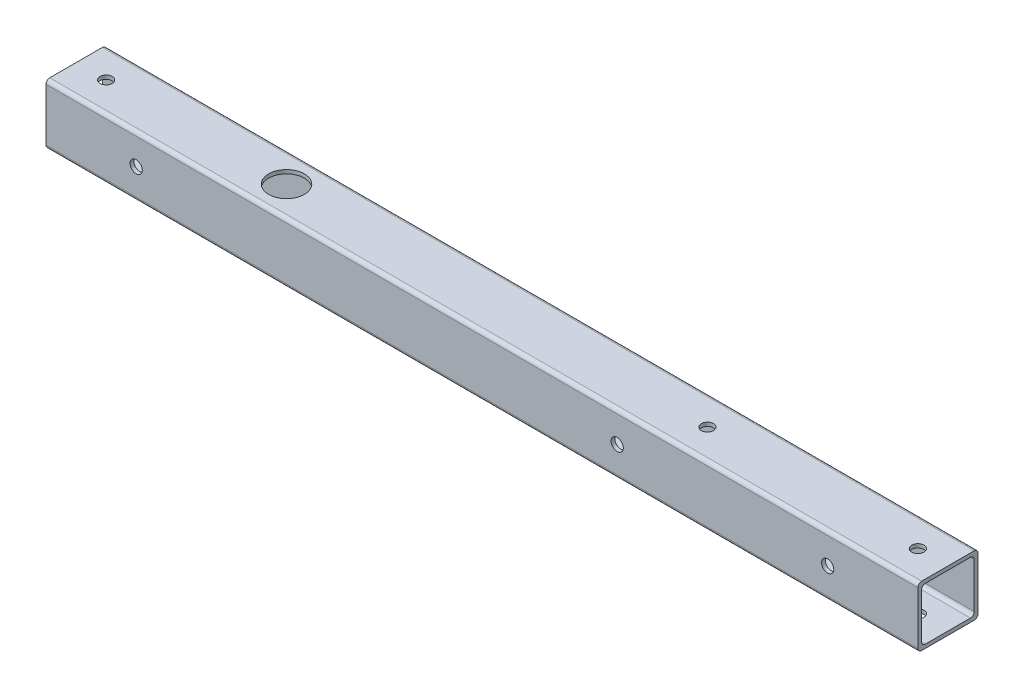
ISO-10303-21;
HEADER;
FILE_DESCRIPTION(('STEP AP214'),'2;1');
FILE_NAME('part.step','',(''),(''),'','','');
FILE_SCHEMA(('AUTOMOTIVE_DESIGN { 1 0 10303 214 1 1 1 1 }'));
ENDSEC;
DATA;
#1=APPLICATION_CONTEXT('core data for automotive mechanical design processes');
#2=APPLICATION_PROTOCOL_DEFINITION('international standard','automotive_design',2000,#1);
#3=PRODUCT_CONTEXT('',#1,'mechanical');
#4=PRODUCT('Part','Part','',(#3));
#5=PRODUCT_RELATED_PRODUCT_CATEGORY('part','',(#4));
#6=PRODUCT_DEFINITION_FORMATION('','',#4);
#7=PRODUCT_DEFINITION_CONTEXT('part definition',#1,'design');
#8=PRODUCT_DEFINITION('design','',#6,#7);
#9=PRODUCT_DEFINITION_SHAPE('','',#8);
#10=(LENGTH_UNIT() NAMED_UNIT(*) SI_UNIT(.MILLI.,.METRE.));
#11=(NAMED_UNIT(*) PLANE_ANGLE_UNIT() SI_UNIT($,.RADIAN.));
#12=(NAMED_UNIT(*) SI_UNIT($,.STERADIAN.) SOLID_ANGLE_UNIT());
#13=UNCERTAINTY_MEASURE_WITH_UNIT(LENGTH_MEASURE(1.E-05),#10,'distance_accuracy_value','');
#14=(GEOMETRIC_REPRESENTATION_CONTEXT(3) GLOBAL_UNCERTAINTY_ASSIGNED_CONTEXT((#13)) GLOBAL_UNIT_ASSIGNED_CONTEXT((#10,
#11,#12)) REPRESENTATION_CONTEXT('',''));
#15=CARTESIAN_POINT('',(0.,0.,0.));
#16=DIRECTION('',(0.,0.,1.));
#17=DIRECTION('',(1.,0.,0.));
#18=AXIS2_PLACEMENT_3D('',#15,#16,#17);
#19=CARTESIAN_POINT('',(0.,101.6,0.));
#20=DIRECTION('',(-1.,0.,0.));
#21=DIRECTION('',(0.,0.,1.));
#22=AXIS2_PLACEMENT_3D('',#19,#20,#21);
#23=PLANE('',#22);
#24=DIRECTION('',(0.,0.,1.));
#25=VECTOR('',#24,1.);
#26=CARTESIAN_POINT('',(0.,95.25,6.35000000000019));
#27=LINE('',#26,#25);
#28=CARTESIAN_POINT('',(0.,95.25,12.7000000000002));
#29=VERTEX_POINT('',#28);
#30=CARTESIAN_POINT('',(0.,95.25,88.9000000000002));
#31=VERTEX_POINT('',#30);
#32=EDGE_CURVE('E169',#29,#31,#27,.T.);
#33=ORIENTED_EDGE('',*,*,#32,.F.);
#34=CARTESIAN_POINT('',(0.,88.9,12.7000000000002));
#35=DIRECTION('',(-1.,0.,0.));
#36=DIRECTION('',(0.,0.,1.));
#37=AXIS2_PLACEMENT_3D('',#34,#35,#36);
#38=CIRCLE('',#37,6.35);
#39=CARTESIAN_POINT('',(0.,88.9,6.35000000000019));
#40=VERTEX_POINT('',#39);
#41=EDGE_CURVE('E179',#29,#40,#38,.T.);
#42=ORIENTED_EDGE('',*,*,#41,.T.);
#43=DIRECTION('',(0.,1.,0.));
#44=VECTOR('',#43,1.);
#45=CARTESIAN_POINT('',(0.,95.25,6.35000000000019));
#46=LINE('',#45,#44);
#47=CARTESIAN_POINT('',(0.,12.7,6.3500000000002));
#48=VERTEX_POINT('',#47);
#49=EDGE_CURVE('E264',#48,#40,#46,.T.);
#50=ORIENTED_EDGE('',*,*,#49,.F.);
#51=CARTESIAN_POINT('',(0.,12.7,12.7000000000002));
#52=DIRECTION('',(-1.,0.,0.));
#53=DIRECTION('',(0.,0.,1.));
#54=AXIS2_PLACEMENT_3D('',#51,#52,#53);
#55=CIRCLE('',#54,6.35);
#56=CARTESIAN_POINT('',(0.,6.35,12.7000000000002));
#57=VERTEX_POINT('',#56);
#58=EDGE_CURVE('E11',#48,#57,#55,.T.);
#59=ORIENTED_EDGE('',*,*,#58,.T.);
#60=DIRECTION('',(0.,0.,-1.));
#61=VECTOR('',#60,1.);
#62=CARTESIAN_POINT('',(0.,6.35,6.35000000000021));
#63=LINE('',#62,#61);
#64=CARTESIAN_POINT('',(0.,6.35,88.9000000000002));
#65=VERTEX_POINT('',#64);
#66=EDGE_CURVE('E277',#65,#57,#63,.T.);
#67=ORIENTED_EDGE('',*,*,#66,.F.);
#68=CARTESIAN_POINT('',(0.,12.7,88.9000000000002));
#69=DIRECTION('',(-1.,0.,0.));
#70=DIRECTION('',(0.,0.,1.));
#71=AXIS2_PLACEMENT_3D('',#68,#69,#70);
#72=CIRCLE('',#71,6.35);
#73=CARTESIAN_POINT('',(0.,12.7,95.2500000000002));
#74=VERTEX_POINT('',#73);
#75=EDGE_CURVE('E168',#65,#74,#72,.T.);
#76=ORIENTED_EDGE('',*,*,#75,.T.);
#77=DIRECTION('',(0.,-1.,0.));
#78=VECTOR('',#77,1.);
#79=CARTESIAN_POINT('',(0.,95.25,95.2500000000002));
#80=LINE('',#79,#78);
#81=CARTESIAN_POINT('',(0.,88.9,95.2500000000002));
#82=VERTEX_POINT('',#81);
#83=EDGE_CURVE('E152',#82,#74,#80,.T.);
#84=ORIENTED_EDGE('',*,*,#83,.F.);
#85=CARTESIAN_POINT('',(0.,88.9,88.9000000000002));
#86=DIRECTION('',(-1.,0.,0.));
#87=DIRECTION('',(0.,0.,1.));
#88=AXIS2_PLACEMENT_3D('',#85,#86,#87);
#89=CIRCLE('',#88,6.35);
#90=EDGE_CURVE('E164',#82,#31,#89,.T.);
#91=ORIENTED_EDGE('',*,*,#90,.T.);
#92=EDGE_LOOP('',(#33,#42,#50,#59,#67,#76,#84,#91));
#93=FACE_BOUND('',#92,.T.);
#94=DIRECTION('',(0.,-1.,0.));
#95=VECTOR('',#94,1.);
#96=CARTESIAN_POINT('',(0.,101.6,101.6));
#97=LINE('',#96,#95);
#98=CARTESIAN_POINT('',(0.,95.25,101.6));
#99=VERTEX_POINT('',#98);
#100=CARTESIAN_POINT('',(0.,6.34999999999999,101.6));
#101=VERTEX_POINT('',#100);
#102=EDGE_CURVE('E288',#99,#101,#97,.T.);
#103=ORIENTED_EDGE('',*,*,#102,.T.);
#104=CARTESIAN_POINT('',(0.,6.34999999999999,95.25));
#105=DIRECTION('',(-1.,0.,0.));
#106=DIRECTION('',(0.,0.,1.));
#107=AXIS2_PLACEMENT_3D('',#104,#105,#106);
#108=CIRCLE('',#107,6.35);
#109=CARTESIAN_POINT('',(0.,0.,95.25));
#110=VERTEX_POINT('',#109);
#111=EDGE_CURVE('E319',#101,#110,#108,.F.);
#112=ORIENTED_EDGE('',*,*,#111,.T.);
#113=DIRECTION('',(0.,0.,-1.));
#114=VECTOR('',#113,1.);
#115=CARTESIAN_POINT('',(0.,0.,0.));
#116=LINE('',#115,#114);
#117=CARTESIAN_POINT('',(0.,0.,6.35));
#118=VERTEX_POINT('',#117);
#119=EDGE_CURVE('E280',#110,#118,#116,.T.);
#120=ORIENTED_EDGE('',*,*,#119,.T.);
#121=CARTESIAN_POINT('',(0.,6.34999999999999,6.35));
#122=DIRECTION('',(-1.,0.,0.));
#123=DIRECTION('',(0.,0.,1.));
#124=AXIS2_PLACEMENT_3D('',#121,#122,#123);
#125=CIRCLE('',#124,6.35);
#126=CARTESIAN_POINT('',(0.,6.34999999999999,0.));
#127=VERTEX_POINT('',#126);
#128=EDGE_CURVE('E313',#118,#127,#125,.F.);
#129=ORIENTED_EDGE('',*,*,#128,.T.);
#130=DIRECTION('',(0.,-1.,0.));
#131=VECTOR('',#130,1.);
#132=CARTESIAN_POINT('',(0.,101.6,0.));
#133=LINE('',#132,#131);
#134=CARTESIAN_POINT('',(0.,95.25,0.));
#135=VERTEX_POINT('',#134);
#136=EDGE_CURVE('E159',#135,#127,#133,.T.);
#137=ORIENTED_EDGE('',*,*,#136,.F.);
#138=CARTESIAN_POINT('',(0.,95.25,6.35));
#139=DIRECTION('',(-1.,0.,0.));
#140=DIRECTION('',(0.,0.,1.));
#141=AXIS2_PLACEMENT_3D('',#138,#139,#140);
#142=CIRCLE('',#141,6.35);
#143=CARTESIAN_POINT('',(0.,101.6,6.35));
#144=VERTEX_POINT('',#143);
#145=EDGE_CURVE('E315',#135,#144,#142,.F.);
#146=ORIENTED_EDGE('',*,*,#145,.T.);
#147=DIRECTION('',(0.,0.,-1.));
#148=VECTOR('',#147,1.);
#149=CARTESIAN_POINT('',(0.,101.6,0.));
#150=LINE('',#149,#148);
#151=CARTESIAN_POINT('',(0.,101.6,95.25));
#152=VERTEX_POINT('',#151);
#153=EDGE_CURVE('E281',#152,#144,#150,.T.);
#154=ORIENTED_EDGE('',*,*,#153,.F.);
#155=CARTESIAN_POINT('',(0.,95.25,95.25));
#156=DIRECTION('',(-1.,0.,0.));
#157=DIRECTION('',(0.,0.,1.));
#158=AXIS2_PLACEMENT_3D('',#155,#156,#157);
#159=CIRCLE('',#158,6.35);
#160=EDGE_CURVE('E317',#152,#99,#159,.F.);
#161=ORIENTED_EDGE('',*,*,#160,.T.);
#162=EDGE_LOOP('',(#103,#112,#120,#129,#137,#146,#154,#161));
#163=FACE_BOUND('',#162,.T.);
#164=ADVANCED_FACE('F31',(#93,#163),#23,.F.);
#165=CARTESIAN_POINT('',(0.,101.6,0.));
#166=DIRECTION('',(0.,0.,1.));
#167=DIRECTION('',(1.,0.,0.));
#168=AXIS2_PLACEMENT_3D('',#165,#166,#167);
#169=PLANE('',#168);
#170=CARTESIAN_POINT('',(-508.,50.7999999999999,0.));
#171=DIRECTION('',(0.,0.,-1.));
#172=DIRECTION('',(-1.,0.,0.));
#173=AXIS2_PLACEMENT_3D('',#170,#171,#172);
#174=CIRCLE('',#173,10.3187499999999);
#175=CARTESIAN_POINT('',(-518.31875,50.7999999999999,0.));
#176=VERTEX_POINT('',#175);
#177=EDGE_CURVE('E219',#176,#176,#174,.T.);
#178=ORIENTED_EDGE('',*,*,#177,.F.);
#179=EDGE_LOOP('',(#178));
#180=FACE_BOUND('',#179,.T.);
#181=CARTESIAN_POINT('',(-152.4,50.8,0.));
#182=DIRECTION('',(0.,0.,-1.));
#183=DIRECTION('',(-1.,0.,0.));
#184=AXIS2_PLACEMENT_3D('',#181,#182,#183);
#185=CIRCLE('',#184,10.31875);
#186=CARTESIAN_POINT('',(-162.71875,50.8,0.));
#187=VERTEX_POINT('',#186);
#188=EDGE_CURVE('E216',#187,#187,#185,.T.);
#189=ORIENTED_EDGE('',*,*,#188,.F.);
#190=EDGE_LOOP('',(#189));
#191=FACE_BOUND('',#190,.T.);
#192=CARTESIAN_POINT('',(-1320.8,50.8,1.6174600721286E-13));
#193=DIRECTION('',(0.,0.,-1.));
#194=DIRECTION('',(-1.,0.,0.));
#195=AXIS2_PLACEMENT_3D('',#192,#193,#194);
#196=CIRCLE('',#195,10.31875);
#197=CARTESIAN_POINT('',(-1331.11875,50.8,1.6300964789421E-13));
#198=VERTEX_POINT('',#197);
#199=EDGE_CURVE('E235',#198,#198,#196,.T.);
#200=ORIENTED_EDGE('',*,*,#199,.F.);
#201=EDGE_LOOP('',(#200));
#202=FACE_BOUND('',#201,.T.);
#203=DIRECTION('',(0.,-1.,0.));
#204=VECTOR('',#203,1.);
#205=CARTESIAN_POINT('',(-1473.2,101.6,1.80409008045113E-13));
#206=LINE('',#205,#204);
#207=CARTESIAN_POINT('',(-1473.2,95.25,1.80409008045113E-13));
#208=VERTEX_POINT('',#207);
#209=CARTESIAN_POINT('',(-1473.2,6.34999999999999,1.80409008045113E-13));
#210=VERTEX_POINT('',#209);
#211=EDGE_CURVE('E298',#208,#210,#206,.T.);
#212=ORIENTED_EDGE('',*,*,#211,.F.);
#213=DIRECTION('',(-1.,0.,0.));
#214=VECTOR('',#213,1.);
#215=CARTESIAN_POINT('',(0.,95.25,0.));
#216=LINE('',#215,#214);
#217=EDGE_CURVE('E347',#208,#135,#216,.F.);
#218=ORIENTED_EDGE('',*,*,#217,.T.);
#219=ORIENTED_EDGE('',*,*,#136,.T.);
#220=DIRECTION('',(-1.,0.,0.));
#221=VECTOR('',#220,1.);
#222=CARTESIAN_POINT('',(-1473.2,6.34999999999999,1.80409008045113E-13));
#223=LINE('',#222,#221);
#224=EDGE_CURVE('E345',#127,#210,#223,.T.);
#225=ORIENTED_EDGE('',*,*,#224,.T.);
#226=EDGE_LOOP('',(#212,#218,#219,#225));
#227=FACE_BOUND('',#226,.T.);
#228=ADVANCED_FACE('F373',(#180,#191,#202,#227),#169,.F.);
#229=CARTESIAN_POINT('',(-1473.2,101.6,1.80409008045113E-13));
#230=DIRECTION('',(1.,0.,0.));
#231=DIRECTION('',(0.,0.,-1.));
#232=AXIS2_PLACEMENT_3D('',#229,#230,#231);
#233=PLANE('',#232);
#234=DIRECTION('',(0.,0.,1.));
#235=VECTOR('',#234,1.);
#236=CARTESIAN_POINT('',(-1473.2,6.35,6.35000000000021));
#237=LINE('',#236,#235);
#238=CARTESIAN_POINT('',(-1473.2,6.35,12.7000000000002));
#239=VERTEX_POINT('',#238);
#240=CARTESIAN_POINT('',(-1473.2,6.35,88.9000000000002));
#241=VERTEX_POINT('',#240);
#242=EDGE_CURVE('E270',#239,#241,#237,.T.);
#243=ORIENTED_EDGE('',*,*,#242,.F.);
#244=CARTESIAN_POINT('',(-1473.2,12.7,12.7000000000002));
#245=DIRECTION('',(1.,0.,0.));
#246=DIRECTION('',(0.,0.,-1.));
#247=AXIS2_PLACEMENT_3D('',#244,#245,#246);
#248=CIRCLE('',#247,6.35);
#249=CARTESIAN_POINT('',(-1473.2,12.7,6.3500000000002));
#250=VERTEX_POINT('',#249);
#251=EDGE_CURVE('E40',#239,#250,#248,.T.);
#252=ORIENTED_EDGE('',*,*,#251,.T.);
#253=DIRECTION('',(0.,-1.,0.));
#254=VECTOR('',#253,1.);
#255=CARTESIAN_POINT('',(-1473.2,95.25,6.35000000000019));
#256=LINE('',#255,#254);
#257=CARTESIAN_POINT('',(-1473.2,88.9,6.35000000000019));
#258=VERTEX_POINT('',#257);
#259=EDGE_CURVE('E267',#258,#250,#256,.T.);
#260=ORIENTED_EDGE('',*,*,#259,.F.);
#261=CARTESIAN_POINT('',(-1473.2,88.9,12.7000000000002));
#262=DIRECTION('',(1.,0.,0.));
#263=DIRECTION('',(0.,0.,-1.));
#264=AXIS2_PLACEMENT_3D('',#261,#262,#263);
#265=CIRCLE('',#264,6.35);
#266=CARTESIAN_POINT('',(-1473.2,95.25,12.7000000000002));
#267=VERTEX_POINT('',#266);
#268=EDGE_CURVE('E176',#258,#267,#265,.T.);
#269=ORIENTED_EDGE('',*,*,#268,.T.);
#270=DIRECTION('',(0.,0.,-1.));
#271=VECTOR('',#270,1.);
#272=CARTESIAN_POINT('',(-1473.2,95.25,6.35000000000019));
#273=LINE('',#272,#271);
#274=CARTESIAN_POINT('',(-1473.2,95.25,88.9000000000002));
#275=VERTEX_POINT('',#274);
#276=EDGE_CURVE('E274',#275,#267,#273,.T.);
#277=ORIENTED_EDGE('',*,*,#276,.F.);
#278=CARTESIAN_POINT('',(-1473.2,88.9,88.9000000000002));
#279=DIRECTION('',(1.,0.,0.));
#280=DIRECTION('',(0.,0.,-1.));
#281=AXIS2_PLACEMENT_3D('',#278,#279,#280);
#282=CIRCLE('',#281,6.35);
#283=CARTESIAN_POINT('',(-1473.2,88.9,95.2500000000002));
#284=VERTEX_POINT('',#283);
#285=EDGE_CURVE('E177',#275,#284,#282,.T.);
#286=ORIENTED_EDGE('',*,*,#285,.T.);
#287=DIRECTION('',(0.,1.,0.));
#288=VECTOR('',#287,1.);
#289=CARTESIAN_POINT('',(-1473.2,95.25,95.2500000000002));
#290=LINE('',#289,#288);
#291=CARTESIAN_POINT('',(-1473.2,12.7,95.2500000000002));
#292=VERTEX_POINT('',#291);
#293=EDGE_CURVE('E155',#292,#284,#290,.T.);
#294=ORIENTED_EDGE('',*,*,#293,.F.);
#295=CARTESIAN_POINT('',(-1473.2,12.7,88.9000000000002));
#296=DIRECTION('',(1.,0.,0.));
#297=DIRECTION('',(0.,0.,-1.));
#298=AXIS2_PLACEMENT_3D('',#295,#296,#297);
#299=CIRCLE('',#298,6.35);
#300=EDGE_CURVE('E349',#292,#241,#299,.T.);
#301=ORIENTED_EDGE('',*,*,#300,.T.);
#302=EDGE_LOOP('',(#243,#252,#260,#269,#277,#286,#294,#301));
#303=FACE_BOUND('',#302,.T.);
#304=DIRECTION('',(0.,0.,1.));
#305=VECTOR('',#304,1.);
#306=CARTESIAN_POINT('',(-1473.2,0.,1.80409008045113E-13));
#307=LINE('',#306,#305);
#308=CARTESIAN_POINT('',(-1473.2,0.,6.35000000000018));
#309=VERTEX_POINT('',#308);
#310=CARTESIAN_POINT('',(-1473.2,0.,95.2500000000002));
#311=VERTEX_POINT('',#310);
#312=EDGE_CURVE('E285',#309,#311,#307,.T.);
#313=ORIENTED_EDGE('',*,*,#312,.T.);
#314=CARTESIAN_POINT('',(-1473.2,6.34999999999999,95.2500000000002));
#315=DIRECTION('',(1.,0.,0.));
#316=DIRECTION('',(0.,0.,-1.));
#317=AXIS2_PLACEMENT_3D('',#314,#315,#316);
#318=CIRCLE('',#317,6.35);
#319=CARTESIAN_POINT('',(-1473.2,6.34999999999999,101.6));
#320=VERTEX_POINT('',#319);
#321=EDGE_CURVE('E329',#311,#320,#318,.F.);
#322=ORIENTED_EDGE('',*,*,#321,.T.);
#323=DIRECTION('',(0.,-1.,0.));
#324=VECTOR('',#323,1.);
#325=CARTESIAN_POINT('',(-1473.2,101.6,101.6));
#326=LINE('',#325,#324);
#327=CARTESIAN_POINT('',(-1473.2,95.25,101.6));
#328=VERTEX_POINT('',#327);
#329=EDGE_CURVE('E295',#328,#320,#326,.T.);
#330=ORIENTED_EDGE('',*,*,#329,.F.);
#331=CARTESIAN_POINT('',(-1473.2,95.25,95.2500000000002));
#332=DIRECTION('',(1.,0.,0.));
#333=DIRECTION('',(0.,0.,-1.));
#334=AXIS2_PLACEMENT_3D('',#331,#332,#333);
#335=CIRCLE('',#334,6.35);
#336=CARTESIAN_POINT('',(-1473.2,101.6,95.2500000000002));
#337=VERTEX_POINT('',#336);
#338=EDGE_CURVE('E327',#328,#337,#335,.F.);
#339=ORIENTED_EDGE('',*,*,#338,.T.);
#340=DIRECTION('',(0.,0.,1.));
#341=VECTOR('',#340,1.);
#342=CARTESIAN_POINT('',(-1473.2,101.6,1.80409008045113E-13));
#343=LINE('',#342,#341);
#344=CARTESIAN_POINT('',(-1473.2,101.6,6.35000000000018));
#345=VERTEX_POINT('',#344);
#346=EDGE_CURVE('E284',#345,#337,#343,.T.);
#347=ORIENTED_EDGE('',*,*,#346,.F.);
#348=CARTESIAN_POINT('',(-1473.2,95.25,6.35000000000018));
#349=DIRECTION('',(1.,0.,0.));
#350=DIRECTION('',(0.,0.,-1.));
#351=AXIS2_PLACEMENT_3D('',#348,#349,#350);
#352=CIRCLE('',#351,6.35);
#353=EDGE_CURVE('E56',#345,#208,#352,.F.);
#354=ORIENTED_EDGE('',*,*,#353,.T.);
#355=ORIENTED_EDGE('',*,*,#211,.T.);
#356=CARTESIAN_POINT('',(-1473.2,6.34999999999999,6.35000000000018));
#357=DIRECTION('',(1.,0.,0.));
#358=DIRECTION('',(0.,0.,-1.));
#359=AXIS2_PLACEMENT_3D('',#356,#357,#358);
#360=CIRCLE('',#359,6.35);
#361=EDGE_CURVE('E48',#210,#309,#360,.F.);
#362=ORIENTED_EDGE('',*,*,#361,.T.);
#363=EDGE_LOOP('',(#313,#322,#330,#339,#347,#354,#355,#362));
#364=FACE_BOUND('',#363,.T.);
#365=ADVANCED_FACE('F352',(#303,#364),#233,.F.);
#366=CARTESIAN_POINT('',(0.,101.6,101.6));
#367=DIRECTION('',(0.,0.,-1.));
#368=DIRECTION('',(-1.,0.,0.));
#369=AXIS2_PLACEMENT_3D('',#366,#367,#368);
#370=PLANE('',#369);
#371=CARTESIAN_POINT('',(-508.,50.7999999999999,101.6));
#372=DIRECTION('',(0.,0.,-1.));
#373=DIRECTION('',(-1.,0.,0.));
#374=AXIS2_PLACEMENT_3D('',#371,#372,#373);
#375=CIRCLE('',#374,10.3187499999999);
#376=CARTESIAN_POINT('',(-518.31875,50.7999999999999,101.6));
#377=VERTEX_POINT('',#376);
#378=EDGE_CURVE('E212',#377,#377,#375,.T.);
#379=ORIENTED_EDGE('',*,*,#378,.T.);
#380=EDGE_LOOP('',(#379));
#381=FACE_BOUND('',#380,.T.);
#382=CARTESIAN_POINT('',(-152.4,50.8,101.6));
#383=DIRECTION('',(0.,0.,-1.));
#384=DIRECTION('',(-1.,0.,0.));
#385=AXIS2_PLACEMENT_3D('',#382,#383,#384);
#386=CIRCLE('',#385,10.31875);
#387=CARTESIAN_POINT('',(-162.71875,50.8,101.6));
#388=VERTEX_POINT('',#387);
#389=EDGE_CURVE('E208',#388,#388,#386,.T.);
#390=ORIENTED_EDGE('',*,*,#389,.T.);
#391=EDGE_LOOP('',(#390));
#392=FACE_BOUND('',#391,.T.);
#393=CARTESIAN_POINT('',(-1320.8,50.8,101.6));
#394=DIRECTION('',(0.,0.,-1.));
#395=DIRECTION('',(-1.,0.,0.));
#396=AXIS2_PLACEMENT_3D('',#393,#394,#395);
#397=CIRCLE('',#396,10.31875);
#398=CARTESIAN_POINT('',(-1331.11875,50.8,101.6));
#399=VERTEX_POINT('',#398);
#400=EDGE_CURVE('E204',#399,#399,#397,.T.);
#401=ORIENTED_EDGE('',*,*,#400,.T.);
#402=EDGE_LOOP('',(#401));
#403=FACE_BOUND('',#402,.T.);
#404=ORIENTED_EDGE('',*,*,#329,.T.);
#405=DIRECTION('',(1.,0.,0.));
#406=VECTOR('',#405,1.);
#407=CARTESIAN_POINT('',(0.,6.34999999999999,101.6));
#408=LINE('',#407,#406);
#409=EDGE_CURVE('E310',#320,#101,#408,.T.);
#410=ORIENTED_EDGE('',*,*,#409,.T.);
#411=ORIENTED_EDGE('',*,*,#102,.F.);
#412=DIRECTION('',(1.,0.,0.));
#413=VECTOR('',#412,1.);
#414=CARTESIAN_POINT('',(0.,95.25,101.6));
#415=LINE('',#414,#413);
#416=EDGE_CURVE('E308',#99,#328,#415,.F.);
#417=ORIENTED_EDGE('',*,*,#416,.T.);
#418=EDGE_LOOP('',(#404,#410,#411,#417));
#419=FACE_BOUND('',#418,.T.);
#420=ADVANCED_FACE('F382',(#381,#392,#403,#419),#370,.F.);
#421=CARTESIAN_POINT('',(0.,101.6,0.));
#422=DIRECTION('',(0.,-1.,0.));
#423=DIRECTION('',(0.,0.,-1.));
#424=AXIS2_PLACEMENT_3D('',#421,#422,#423);
#425=PLANE('',#424);
#426=CARTESIAN_POINT('',(-406.4,101.6,50.8000000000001));
#427=DIRECTION('',(0.,1.,0.));
#428=DIRECTION('',(0.,0.,1.));
#429=AXIS2_PLACEMENT_3D('',#426,#427,#428);
#430=CIRCLE('',#429,10.31875);
#431=CARTESIAN_POINT('',(-406.4,101.6,61.11875));
#432=VERTEX_POINT('',#431);
#433=EDGE_CURVE('E444',#432,#432,#430,.T.);
#434=ORIENTED_EDGE('',*,*,#433,.F.);
#435=EDGE_LOOP('',(#434));
#436=FACE_BOUND('',#435,.T.);
#437=CARTESIAN_POINT('',(-1117.6,101.6,50.8000000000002));
#438=DIRECTION('',(0.,1.,0.));
#439=DIRECTION('',(0.,0.,1.));
#440=AXIS2_PLACEMENT_3D('',#437,#438,#439);
#441=CIRCLE('',#440,30.1625000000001);
#442=CARTESIAN_POINT('',(-1117.6,101.6,80.9625000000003));
#443=VERTEX_POINT('',#442);
#444=EDGE_CURVE('E242',#443,#443,#441,.T.);
#445=ORIENTED_EDGE('',*,*,#444,.F.);
#446=EDGE_LOOP('',(#445));
#447=FACE_BOUND('',#446,.T.);
#448=CARTESIAN_POINT('',(-50.8,101.6,50.8));
#449=DIRECTION('',(0.,1.,0.));
#450=DIRECTION('',(0.,0.,1.));
#451=AXIS2_PLACEMENT_3D('',#448,#449,#450);
#452=CIRCLE('',#451,10.31875);
#453=CARTESIAN_POINT('',(-50.8,101.6,61.11875));
#454=VERTEX_POINT('',#453);
#455=EDGE_CURVE('E249',#454,#454,#452,.T.);
#456=ORIENTED_EDGE('',*,*,#455,.F.);
#457=EDGE_LOOP('',(#456));
#458=FACE_BOUND('',#457,.T.);
#459=CARTESIAN_POINT('',(-1422.4,101.6,50.8000000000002));
#460=DIRECTION('',(0.,1.,0.));
#461=DIRECTION('',(0.,0.,1.));
#462=AXIS2_PLACEMENT_3D('',#459,#460,#461);
#463=CIRCLE('',#462,10.31875);
#464=CARTESIAN_POINT('',(-1422.4,101.6,61.1187500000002));
#465=VERTEX_POINT('',#464);
#466=EDGE_CURVE('E256',#465,#465,#463,.T.);
#467=ORIENTED_EDGE('',*,*,#466,.F.);
#468=EDGE_LOOP('',(#467));
#469=FACE_BOUND('',#468,.T.);
#470=ORIENTED_EDGE('',*,*,#346,.T.);
#471=DIRECTION('',(1.,0.,0.));
#472=VECTOR('',#471,1.);
#473=CARTESIAN_POINT('',(0.,101.6,95.25));
#474=LINE('',#473,#472);
#475=EDGE_CURVE('E334',#337,#152,#474,.T.);
#476=ORIENTED_EDGE('',*,*,#475,.T.);
#477=ORIENTED_EDGE('',*,*,#153,.T.);
#478=DIRECTION('',(-1.,0.,0.));
#479=VECTOR('',#478,1.);
#480=CARTESIAN_POINT('',(0.,101.6,6.35));
#481=LINE('',#480,#479);
#482=EDGE_CURVE('E331',#144,#345,#481,.T.);
#483=ORIENTED_EDGE('',*,*,#482,.T.);
#484=EDGE_LOOP('',(#470,#476,#477,#483));
#485=FACE_BOUND('',#484,.T.);
#486=ADVANCED_FACE('F385',(#436,#447,#458,#469,#485),#425,.F.);
#487=CARTESIAN_POINT('',(0.,0.,0.));
#488=DIRECTION('',(0.,-1.,0.));
#489=DIRECTION('',(0.,0.,-1.));
#490=AXIS2_PLACEMENT_3D('',#487,#488,#489);
#491=PLANE('',#490);
#492=CARTESIAN_POINT('',(-406.4,0.,50.8000000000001));
#493=DIRECTION('',(0.,1.,0.));
#494=DIRECTION('',(0.,0.,1.));
#495=AXIS2_PLACEMENT_3D('',#492,#493,#494);
#496=CIRCLE('',#495,10.31875);
#497=CARTESIAN_POINT('',(-406.4,0.,61.11875));
#498=VERTEX_POINT('',#497);
#499=EDGE_CURVE('E448',#498,#498,#496,.T.);
#500=ORIENTED_EDGE('',*,*,#499,.T.);
#501=EDGE_LOOP('',(#500));
#502=FACE_BOUND('',#501,.T.);
#503=CARTESIAN_POINT('',(-1117.6,0.,50.8000000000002));
#504=DIRECTION('',(0.,1.,0.));
#505=DIRECTION('',(0.,0.,1.));
#506=AXIS2_PLACEMENT_3D('',#503,#504,#505);
#507=CIRCLE('',#506,30.1625000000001);
#508=CARTESIAN_POINT('',(-1117.6,0.,80.9625000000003));
#509=VERTEX_POINT('',#508);
#510=EDGE_CURVE('E199',#509,#509,#507,.T.);
#511=ORIENTED_EDGE('',*,*,#510,.T.);
#512=EDGE_LOOP('',(#511));
#513=FACE_BOUND('',#512,.T.);
#514=CARTESIAN_POINT('',(-50.8,0.,50.8));
#515=DIRECTION('',(0.,1.,0.));
#516=DIRECTION('',(0.,0.,1.));
#517=AXIS2_PLACEMENT_3D('',#514,#515,#516);
#518=CIRCLE('',#517,10.31875);
#519=CARTESIAN_POINT('',(-50.8,0.,61.11875));
#520=VERTEX_POINT('',#519);
#521=EDGE_CURVE('E194',#520,#520,#518,.T.);
#522=ORIENTED_EDGE('',*,*,#521,.T.);
#523=EDGE_LOOP('',(#522));
#524=FACE_BOUND('',#523,.T.);
#525=CARTESIAN_POINT('',(-1422.4,0.,50.8000000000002));
#526=DIRECTION('',(0.,1.,0.));
#527=DIRECTION('',(0.,0.,1.));
#528=AXIS2_PLACEMENT_3D('',#525,#526,#527);
#529=CIRCLE('',#528,10.31875);
#530=CARTESIAN_POINT('',(-1422.4,0.,61.1187500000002));
#531=VERTEX_POINT('',#530);
#532=EDGE_CURVE('E189',#531,#531,#529,.T.);
#533=ORIENTED_EDGE('',*,*,#532,.T.);
#534=EDGE_LOOP('',(#533));
#535=FACE_BOUND('',#534,.T.);
#536=ORIENTED_EDGE('',*,*,#119,.F.);
#537=DIRECTION('',(1.,0.,0.));
#538=VECTOR('',#537,1.);
#539=CARTESIAN_POINT('',(-1473.2,0.,95.2500000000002));
#540=LINE('',#539,#538);
#541=EDGE_CURVE('E323',#110,#311,#540,.F.);
#542=ORIENTED_EDGE('',*,*,#541,.T.);
#543=ORIENTED_EDGE('',*,*,#312,.F.);
#544=DIRECTION('',(-1.,0.,0.));
#545=VECTOR('',#544,1.);
#546=CARTESIAN_POINT('',(0.,0.,6.35));
#547=LINE('',#546,#545);
#548=EDGE_CURVE('E321',#309,#118,#547,.F.);
#549=ORIENTED_EDGE('',*,*,#548,.T.);
#550=EDGE_LOOP('',(#536,#542,#543,#549));
#551=FACE_BOUND('',#550,.T.);
#552=ADVANCED_FACE('F386',(#502,#513,#524,#535,#551),#491,.T.);
#553=CARTESIAN_POINT('',(0.000999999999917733,95.25,6.35000000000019));
#554=DIRECTION('',(0.,0.,-1.));
#555=DIRECTION('',(0.,1.,0.));
#556=AXIS2_PLACEMENT_3D('',#553,#554,#555);
#557=PLANE('',#556);
#558=CARTESIAN_POINT('',(-508.,50.7999999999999,6.3500000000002));
#559=DIRECTION('',(0.,0.,-1.));
#560=DIRECTION('',(0.,1.,0.));
#561=AXIS2_PLACEMENT_3D('',#558,#559,#560);
#562=CIRCLE('',#561,10.3187499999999);
#563=CARTESIAN_POINT('',(-508.,61.1187499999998,6.3500000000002));
#564=VERTEX_POINT('',#563);
#565=EDGE_CURVE('E211',#564,#564,#562,.T.);
#566=ORIENTED_EDGE('',*,*,#565,.T.);
#567=EDGE_LOOP('',(#566));
#568=FACE_BOUND('',#567,.T.);
#569=CARTESIAN_POINT('',(-152.4,50.8,6.3500000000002));
#570=DIRECTION('',(0.,0.,-1.));
#571=DIRECTION('',(0.,1.,0.));
#572=AXIS2_PLACEMENT_3D('',#569,#570,#571);
#573=CIRCLE('',#572,10.31875);
#574=CARTESIAN_POINT('',(-152.4,61.11875,6.3500000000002));
#575=VERTEX_POINT('',#574);
#576=EDGE_CURVE('E207',#575,#575,#573,.T.);
#577=ORIENTED_EDGE('',*,*,#576,.T.);
#578=EDGE_LOOP('',(#577));
#579=FACE_BOUND('',#578,.T.);
#580=CARTESIAN_POINT('',(-1320.8,50.8,6.3500000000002));
#581=DIRECTION('',(0.,0.,-1.));
#582=DIRECTION('',(0.,1.,0.));
#583=AXIS2_PLACEMENT_3D('',#580,#581,#582);
#584=CIRCLE('',#583,10.31875);
#585=CARTESIAN_POINT('',(-1320.8,61.11875,6.3500000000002));
#586=VERTEX_POINT('',#585);
#587=EDGE_CURVE('E203',#586,#586,#584,.T.);
#588=ORIENTED_EDGE('',*,*,#587,.T.);
#589=EDGE_LOOP('',(#588));
#590=FACE_BOUND('',#589,.T.);
#591=ORIENTED_EDGE('',*,*,#49,.T.);
#592=DIRECTION('',(-1.,0.,0.));
#593=VECTOR('',#592,1.);
#594=CARTESIAN_POINT('',(-1473.2,88.9,6.35000000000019));
#595=LINE('',#594,#593);
#596=EDGE_CURVE('E342',#40,#258,#595,.T.);
#597=ORIENTED_EDGE('',*,*,#596,.T.);
#598=ORIENTED_EDGE('',*,*,#259,.T.);
#599=DIRECTION('',(-1.,0.,0.));
#600=VECTOR('',#599,1.);
#601=CARTESIAN_POINT('',(0.,12.7,6.3500000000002));
#602=LINE('',#601,#600);
#603=EDGE_CURVE('E340',#250,#48,#602,.F.);
#604=ORIENTED_EDGE('',*,*,#603,.T.);
#605=EDGE_LOOP('',(#591,#597,#598,#604));
#606=FACE_BOUND('',#605,.T.);
#607=ADVANCED_FACE('F389',(#568,#579,#590,#606),#557,.F.);
#608=CARTESIAN_POINT('',(0.000999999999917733,95.25,6.35000000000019));
#609=DIRECTION('',(0.,1.,0.));
#610=DIRECTION('',(0.,0.,1.));
#611=AXIS2_PLACEMENT_3D('',#608,#609,#610);
#612=PLANE('',#611);
#613=CARTESIAN_POINT('',(-406.4,95.25,50.8000000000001));
#614=DIRECTION('',(0.,1.,0.));
#615=DIRECTION('',(0.,0.,1.));
#616=AXIS2_PLACEMENT_3D('',#613,#614,#615);
#617=CIRCLE('',#616,10.31875);
#618=CARTESIAN_POINT('',(-406.4,95.25,61.11875));
#619=VERTEX_POINT('',#618);
#620=EDGE_CURVE('E224',#619,#619,#617,.T.);
#621=ORIENTED_EDGE('',*,*,#620,.T.);
#622=EDGE_LOOP('',(#621));
#623=FACE_BOUND('',#622,.T.);
#624=CARTESIAN_POINT('',(-1117.6,95.25,50.8000000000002));
#625=DIRECTION('',(0.,1.,0.));
#626=DIRECTION('',(0.,0.,1.));
#627=AXIS2_PLACEMENT_3D('',#624,#625,#626);
#628=CIRCLE('',#627,30.1625000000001);
#629=CARTESIAN_POINT('',(-1117.6,95.25,80.9625000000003));
#630=VERTEX_POINT('',#629);
#631=EDGE_CURVE('E198',#630,#630,#628,.T.);
#632=ORIENTED_EDGE('',*,*,#631,.T.);
#633=EDGE_LOOP('',(#632));
#634=FACE_BOUND('',#633,.T.);
#635=CARTESIAN_POINT('',(-50.8,95.25,50.8));
#636=DIRECTION('',(0.,1.,0.));
#637=DIRECTION('',(0.,0.,1.));
#638=AXIS2_PLACEMENT_3D('',#635,#636,#637);
#639=CIRCLE('',#638,10.31875);
#640=CARTESIAN_POINT('',(-50.8,95.25,61.11875));
#641=VERTEX_POINT('',#640);
#642=EDGE_CURVE('E193',#641,#641,#639,.T.);
#643=ORIENTED_EDGE('',*,*,#642,.T.);
#644=EDGE_LOOP('',(#643));
#645=FACE_BOUND('',#644,.T.);
#646=CARTESIAN_POINT('',(-1422.4,95.25,50.8000000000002));
#647=DIRECTION('',(0.,1.,0.));
#648=DIRECTION('',(0.,0.,1.));
#649=AXIS2_PLACEMENT_3D('',#646,#647,#648);
#650=CIRCLE('',#649,10.31875);
#651=CARTESIAN_POINT('',(-1422.4,95.25,61.1187500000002));
#652=VERTEX_POINT('',#651);
#653=EDGE_CURVE('E170',#652,#652,#650,.T.);
#654=ORIENTED_EDGE('',*,*,#653,.T.);
#655=EDGE_LOOP('',(#654));
#656=FACE_BOUND('',#655,.T.);
#657=ORIENTED_EDGE('',*,*,#32,.T.);
#658=DIRECTION('',(-1.,0.,0.));
#659=VECTOR('',#658,1.);
#660=CARTESIAN_POINT('',(-1473.2,95.25,88.9000000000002));
#661=LINE('',#660,#659);
#662=EDGE_CURVE('E175',#31,#275,#661,.T.);
#663=ORIENTED_EDGE('',*,*,#662,.T.);
#664=ORIENTED_EDGE('',*,*,#276,.T.);
#665=DIRECTION('',(-1.,0.,0.));
#666=VECTOR('',#665,1.);
#667=CARTESIAN_POINT('',(0.,95.25,12.7000000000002));
#668=LINE('',#667,#666);
#669=EDGE_CURVE('E337',#267,#29,#668,.F.);
#670=ORIENTED_EDGE('',*,*,#669,.T.);
#671=EDGE_LOOP('',(#657,#663,#664,#670));
#672=FACE_BOUND('',#671,.T.);
#673=ADVANCED_FACE('F395',(#623,#634,#645,#656,#672),#612,.F.);
#674=CARTESIAN_POINT('',(0.000999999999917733,95.25,95.2500000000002));
#675=DIRECTION('',(0.,0.,1.));
#676=DIRECTION('',(0.,-1.,0.));
#677=AXIS2_PLACEMENT_3D('',#674,#675,#676);
#678=PLANE('',#677);
#679=CARTESIAN_POINT('',(-508.,50.7999999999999,95.2500000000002));
#680=DIRECTION('',(0.,0.,1.));
#681=DIRECTION('',(0.,-1.,0.));
#682=AXIS2_PLACEMENT_3D('',#679,#680,#681);
#683=CIRCLE('',#682,10.3187499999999);
#684=CARTESIAN_POINT('',(-508.,40.48125,95.2500000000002));
#685=VERTEX_POINT('',#684);
#686=EDGE_CURVE('E209',#685,#685,#683,.T.);
#687=ORIENTED_EDGE('',*,*,#686,.T.);
#688=EDGE_LOOP('',(#687));
#689=FACE_BOUND('',#688,.T.);
#690=CARTESIAN_POINT('',(-152.4,50.8,95.2500000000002));
#691=DIRECTION('',(0.,0.,1.));
#692=DIRECTION('',(0.,-1.,0.));
#693=AXIS2_PLACEMENT_3D('',#690,#691,#692);
#694=CIRCLE('',#693,10.31875);
#695=CARTESIAN_POINT('',(-152.4,40.48125,95.2500000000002));
#696=VERTEX_POINT('',#695);
#697=EDGE_CURVE('E205',#696,#696,#694,.T.);
#698=ORIENTED_EDGE('',*,*,#697,.T.);
#699=EDGE_LOOP('',(#698));
#700=FACE_BOUND('',#699,.T.);
#701=CARTESIAN_POINT('',(-1320.8,50.8,95.2500000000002));
#702=DIRECTION('',(0.,0.,1.));
#703=DIRECTION('',(0.,-1.,0.));
#704=AXIS2_PLACEMENT_3D('',#701,#702,#703);
#705=CIRCLE('',#704,10.31875);
#706=CARTESIAN_POINT('',(-1320.8,40.48125,95.2500000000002));
#707=VERTEX_POINT('',#706);
#708=EDGE_CURVE('E200',#707,#707,#705,.T.);
#709=ORIENTED_EDGE('',*,*,#708,.T.);
#710=EDGE_LOOP('',(#709));
#711=FACE_BOUND('',#710,.T.);
#712=ORIENTED_EDGE('',*,*,#83,.T.);
#713=DIRECTION('',(-1.,0.,0.));
#714=VECTOR('',#713,1.);
#715=CARTESIAN_POINT('',(-1473.2,12.7,95.2500000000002));
#716=LINE('',#715,#714);
#717=EDGE_CURVE('E158',#74,#292,#716,.T.);
#718=ORIENTED_EDGE('',*,*,#717,.T.);
#719=ORIENTED_EDGE('',*,*,#293,.T.);
#720=DIRECTION('',(-1.,0.,0.));
#721=VECTOR('',#720,1.);
#722=CARTESIAN_POINT('',(0.,88.9,95.2500000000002));
#723=LINE('',#722,#721);
#724=EDGE_CURVE('E148',#284,#82,#723,.F.);
#725=ORIENTED_EDGE('',*,*,#724,.T.);
#726=EDGE_LOOP('',(#712,#718,#719,#725));
#727=FACE_BOUND('',#726,.T.);
#728=ADVANCED_FACE('F150',(#689,#700,#711,#727),#678,.F.);
#729=CARTESIAN_POINT('',(0.000999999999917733,6.35,6.35000000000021));
#730=DIRECTION('',(0.,-1.,0.));
#731=DIRECTION('',(0.,0.,-1.));
#732=AXIS2_PLACEMENT_3D('',#729,#730,#731);
#733=PLANE('',#732);
#734=CARTESIAN_POINT('',(-406.4,6.35,50.8000000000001));
#735=DIRECTION('',(0.,-1.,0.));
#736=DIRECTION('',(0.,0.,-1.));
#737=AXIS2_PLACEMENT_3D('',#734,#735,#736);
#738=CIRCLE('',#737,10.31875);
#739=CARTESIAN_POINT('',(-406.4,6.35,40.4812500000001));
#740=VERTEX_POINT('',#739);
#741=EDGE_CURVE('E35',#740,#740,#738,.T.);
#742=ORIENTED_EDGE('',*,*,#741,.T.);
#743=EDGE_LOOP('',(#742));
#744=FACE_BOUND('',#743,.T.);
#745=CARTESIAN_POINT('',(-1117.6,6.35,50.8000000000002));
#746=DIRECTION('',(0.,-1.,0.));
#747=DIRECTION('',(0.,0.,-1.));
#748=AXIS2_PLACEMENT_3D('',#745,#746,#747);
#749=CIRCLE('',#748,30.1625000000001);
#750=CARTESIAN_POINT('',(-1117.6,6.35,20.6375000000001));
#751=VERTEX_POINT('',#750);
#752=EDGE_CURVE('E195',#751,#751,#749,.T.);
#753=ORIENTED_EDGE('',*,*,#752,.T.);
#754=EDGE_LOOP('',(#753));
#755=FACE_BOUND('',#754,.T.);
#756=CARTESIAN_POINT('',(-50.8,6.35,50.8));
#757=DIRECTION('',(0.,-1.,0.));
#758=DIRECTION('',(0.,0.,-1.));
#759=AXIS2_PLACEMENT_3D('',#756,#757,#758);
#760=CIRCLE('',#759,10.31875);
#761=CARTESIAN_POINT('',(-50.8,6.35,40.48125));
#762=VERTEX_POINT('',#761);
#763=EDGE_CURVE('E190',#762,#762,#760,.T.);
#764=ORIENTED_EDGE('',*,*,#763,.T.);
#765=EDGE_LOOP('',(#764));
#766=FACE_BOUND('',#765,.T.);
#767=CARTESIAN_POINT('',(-1422.4,6.35,50.8000000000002));
#768=DIRECTION('',(0.,-1.,0.));
#769=DIRECTION('',(0.,0.,-1.));
#770=AXIS2_PLACEMENT_3D('',#767,#768,#769);
#771=CIRCLE('',#770,10.31875);
#772=CARTESIAN_POINT('',(-1422.4,6.35,40.4812500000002));
#773=VERTEX_POINT('',#772);
#774=EDGE_CURVE('E186',#773,#773,#771,.T.);
#775=ORIENTED_EDGE('',*,*,#774,.T.);
#776=EDGE_LOOP('',(#775));
#777=FACE_BOUND('',#776,.T.);
#778=ORIENTED_EDGE('',*,*,#242,.T.);
#779=DIRECTION('',(-1.,0.,0.));
#780=VECTOR('',#779,1.);
#781=CARTESIAN_POINT('',(0.,6.35,88.9000000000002));
#782=LINE('',#781,#780);
#783=EDGE_CURVE('E306',#241,#65,#782,.F.);
#784=ORIENTED_EDGE('',*,*,#783,.T.);
#785=ORIENTED_EDGE('',*,*,#66,.T.);
#786=DIRECTION('',(-1.,0.,0.));
#787=VECTOR('',#786,1.);
#788=CARTESIAN_POINT('',(-1473.2,6.35,12.7000000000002));
#789=LINE('',#788,#787);
#790=EDGE_CURVE('E303',#57,#239,#789,.T.);
#791=ORIENTED_EDGE('',*,*,#790,.T.);
#792=EDGE_LOOP('',(#778,#784,#785,#791));
#793=FACE_BOUND('',#792,.T.);
#794=ADVANCED_FACE('F356',(#744,#755,#766,#777,#793),#733,.F.);
#795=CARTESIAN_POINT('',(0.000999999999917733,12.7,88.9000000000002));
#796=DIRECTION('',(1.,0.,0.));
#797=DIRECTION('',(0.,0.,-1.));
#798=AXIS2_PLACEMENT_3D('',#795,#796,#797);
#799=CYLINDRICAL_SURFACE('',#798,6.35);
#800=ORIENTED_EDGE('',*,*,#75,.F.);
#801=ORIENTED_EDGE('',*,*,#783,.F.);
#802=ORIENTED_EDGE('',*,*,#300,.F.);
#803=ORIENTED_EDGE('',*,*,#717,.F.);
#804=EDGE_LOOP('',(#800,#801,#802,#803));
#805=FACE_BOUND('',#804,.T.);
#806=ADVANCED_FACE('F358',(#805),#799,.F.);
#807=CARTESIAN_POINT('',(0.,6.34999999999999,95.25));
#808=DIRECTION('',(-1.,0.,0.));
#809=DIRECTION('',(0.,0.,1.));
#810=AXIS2_PLACEMENT_3D('',#807,#808,#809);
#811=CYLINDRICAL_SURFACE('',#810,6.35);
#812=ORIENTED_EDGE('',*,*,#321,.F.);
#813=ORIENTED_EDGE('',*,*,#541,.F.);
#814=ORIENTED_EDGE('',*,*,#111,.F.);
#815=ORIENTED_EDGE('',*,*,#409,.F.);
#816=EDGE_LOOP('',(#812,#813,#814,#815));
#817=FACE_BOUND('',#816,.T.);
#818=ADVANCED_FACE('F360',(#817),#811,.T.);
#819=CARTESIAN_POINT('',(0.,95.25,95.25));
#820=DIRECTION('',(1.,0.,0.));
#821=DIRECTION('',(0.,0.,-1.));
#822=AXIS2_PLACEMENT_3D('',#819,#820,#821);
#823=CYLINDRICAL_SURFACE('',#822,6.35);
#824=ORIENTED_EDGE('',*,*,#338,.F.);
#825=ORIENTED_EDGE('',*,*,#416,.F.);
#826=ORIENTED_EDGE('',*,*,#160,.F.);
#827=ORIENTED_EDGE('',*,*,#475,.F.);
#828=EDGE_LOOP('',(#824,#825,#826,#827));
#829=FACE_BOUND('',#828,.T.);
#830=ADVANCED_FACE('F366',(#829),#823,.T.);
#831=CARTESIAN_POINT('',(0.000999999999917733,88.9,88.9000000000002));
#832=DIRECTION('',(1.,0.,0.));
#833=DIRECTION('',(0.,0.,-1.));
#834=AXIS2_PLACEMENT_3D('',#831,#832,#833);
#835=CYLINDRICAL_SURFACE('',#834,6.35);
#836=ORIENTED_EDGE('',*,*,#90,.F.);
#837=ORIENTED_EDGE('',*,*,#724,.F.);
#838=ORIENTED_EDGE('',*,*,#285,.F.);
#839=ORIENTED_EDGE('',*,*,#662,.F.);
#840=EDGE_LOOP('',(#836,#837,#838,#839));
#841=FACE_BOUND('',#840,.T.);
#842=ADVANCED_FACE('F173',(#841),#835,.F.);
#843=CARTESIAN_POINT('',(0.000999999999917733,88.9,12.7000000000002));
#844=DIRECTION('',(1.,0.,0.));
#845=DIRECTION('',(0.,0.,-1.));
#846=AXIS2_PLACEMENT_3D('',#843,#844,#845);
#847=CYLINDRICAL_SURFACE('',#846,6.35);
#848=ORIENTED_EDGE('',*,*,#41,.F.);
#849=ORIENTED_EDGE('',*,*,#669,.F.);
#850=ORIENTED_EDGE('',*,*,#268,.F.);
#851=ORIENTED_EDGE('',*,*,#596,.F.);
#852=EDGE_LOOP('',(#848,#849,#850,#851));
#853=FACE_BOUND('',#852,.T.);
#854=ADVANCED_FACE('F494',(#853),#847,.F.);
#855=CARTESIAN_POINT('',(0.,95.25,6.35));
#856=DIRECTION('',(-1.,0.,0.));
#857=DIRECTION('',(0.,0.,1.));
#858=AXIS2_PLACEMENT_3D('',#855,#856,#857);
#859=CYLINDRICAL_SURFACE('',#858,6.35);
#860=ORIENTED_EDGE('',*,*,#145,.F.);
#861=ORIENTED_EDGE('',*,*,#217,.F.);
#862=ORIENTED_EDGE('',*,*,#353,.F.);
#863=ORIENTED_EDGE('',*,*,#482,.F.);
#864=EDGE_LOOP('',(#860,#861,#862,#863));
#865=FACE_BOUND('',#864,.T.);
#866=ADVANCED_FACE('F479',(#865),#859,.T.);
#867=CARTESIAN_POINT('',(0.000999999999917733,12.7,12.7000000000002));
#868=DIRECTION('',(1.,0.,0.));
#869=DIRECTION('',(0.,0.,-1.));
#870=AXIS2_PLACEMENT_3D('',#867,#868,#869);
#871=CYLINDRICAL_SURFACE('',#870,6.35);
#872=ORIENTED_EDGE('',*,*,#58,.F.);
#873=ORIENTED_EDGE('',*,*,#603,.F.);
#874=ORIENTED_EDGE('',*,*,#251,.F.);
#875=ORIENTED_EDGE('',*,*,#790,.F.);
#876=EDGE_LOOP('',(#872,#873,#874,#875));
#877=FACE_BOUND('',#876,.T.);
#878=ADVANCED_FACE('F484',(#877),#871,.F.);
#879=CARTESIAN_POINT('',(0.,6.34999999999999,6.35));
#880=DIRECTION('',(1.,0.,0.));
#881=DIRECTION('',(0.,0.,-1.));
#882=AXIS2_PLACEMENT_3D('',#879,#880,#881);
#883=CYLINDRICAL_SURFACE('',#882,6.35);
#884=ORIENTED_EDGE('',*,*,#128,.F.);
#885=ORIENTED_EDGE('',*,*,#548,.F.);
#886=ORIENTED_EDGE('',*,*,#361,.F.);
#887=ORIENTED_EDGE('',*,*,#224,.F.);
#888=EDGE_LOOP('',(#884,#885,#886,#887));
#889=FACE_BOUND('',#888,.T.);
#890=ADVANCED_FACE('F33',(#889),#883,.T.);
#891=CARTESIAN_POINT('',(-1422.4,0.,50.8000000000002));
#892=DIRECTION('',(0.,1.,0.));
#893=DIRECTION('',(0.,0.,1.));
#894=AXIS2_PLACEMENT_3D('',#891,#892,#893);
#895=CYLINDRICAL_SURFACE('',#894,10.31875);
#896=ORIENTED_EDGE('',*,*,#532,.F.);
#897=EDGE_LOOP('',(#896));
#898=FACE_BOUND('',#897,.T.);
#899=ORIENTED_EDGE('',*,*,#774,.F.);
#900=EDGE_LOOP('',(#899));
#901=FACE_BOUND('',#900,.T.);
#902=ADVANCED_FACE('F407',(#898,#901),#895,.F.);
#903=ORIENTED_EDGE('',*,*,#466,.T.);
#904=EDGE_LOOP('',(#903));
#905=FACE_BOUND('',#904,.T.);
#906=ORIENTED_EDGE('',*,*,#653,.F.);
#907=EDGE_LOOP('',(#906));
#908=FACE_BOUND('',#907,.T.);
#909=ADVANCED_FACE('F403',(#905,#908),#895,.F.);
#910=CARTESIAN_POINT('',(-50.8,0.,50.8));
#911=DIRECTION('',(0.,1.,0.));
#912=DIRECTION('',(0.,0.,1.));
#913=AXIS2_PLACEMENT_3D('',#910,#911,#912);
#914=CYLINDRICAL_SURFACE('',#913,10.31875);
#915=ORIENTED_EDGE('',*,*,#521,.F.);
#916=EDGE_LOOP('',(#915));
#917=FACE_BOUND('',#916,.T.);
#918=ORIENTED_EDGE('',*,*,#763,.F.);
#919=EDGE_LOOP('',(#918));
#920=FACE_BOUND('',#919,.T.);
#921=ADVANCED_FACE('F406',(#917,#920),#914,.F.);
#922=ORIENTED_EDGE('',*,*,#455,.T.);
#923=EDGE_LOOP('',(#922));
#924=FACE_BOUND('',#923,.T.);
#925=ORIENTED_EDGE('',*,*,#642,.F.);
#926=EDGE_LOOP('',(#925));
#927=FACE_BOUND('',#926,.T.);
#928=ADVANCED_FACE('F409',(#924,#927),#914,.F.);
#929=CARTESIAN_POINT('',(-1117.6,0.,50.8000000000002));
#930=DIRECTION('',(0.,1.,0.));
#931=DIRECTION('',(0.,0.,1.));
#932=AXIS2_PLACEMENT_3D('',#929,#930,#931);
#933=CYLINDRICAL_SURFACE('',#932,30.1625000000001);
#934=ORIENTED_EDGE('',*,*,#510,.F.);
#935=EDGE_LOOP('',(#934));
#936=FACE_BOUND('',#935,.T.);
#937=ORIENTED_EDGE('',*,*,#752,.F.);
#938=EDGE_LOOP('',(#937));
#939=FACE_BOUND('',#938,.T.);
#940=ADVANCED_FACE('F412',(#936,#939),#933,.F.);
#941=ORIENTED_EDGE('',*,*,#444,.T.);
#942=EDGE_LOOP('',(#941));
#943=FACE_BOUND('',#942,.T.);
#944=ORIENTED_EDGE('',*,*,#631,.F.);
#945=EDGE_LOOP('',(#944));
#946=FACE_BOUND('',#945,.T.);
#947=ADVANCED_FACE('F414',(#943,#946),#933,.F.);
#948=CARTESIAN_POINT('',(-1320.8,50.8,101.6));
#949=DIRECTION('',(0.,0.,-1.));
#950=DIRECTION('',(-1.,0.,0.));
#951=AXIS2_PLACEMENT_3D('',#948,#949,#950);
#952=CYLINDRICAL_SURFACE('',#951,10.31875);
#953=ORIENTED_EDGE('',*,*,#400,.F.);
#954=EDGE_LOOP('',(#953));
#955=FACE_BOUND('',#954,.T.);
#956=ORIENTED_EDGE('',*,*,#708,.F.);
#957=EDGE_LOOP('',(#956));
#958=FACE_BOUND('',#957,.T.);
#959=ADVANCED_FACE('F417',(#955,#958),#952,.F.);
#960=ORIENTED_EDGE('',*,*,#199,.T.);
#961=EDGE_LOOP('',(#960));
#962=FACE_BOUND('',#961,.T.);
#963=ORIENTED_EDGE('',*,*,#587,.F.);
#964=EDGE_LOOP('',(#963));
#965=FACE_BOUND('',#964,.T.);
#966=ADVANCED_FACE('F419',(#962,#965),#952,.F.);
#967=CARTESIAN_POINT('',(-152.4,50.8,101.6));
#968=DIRECTION('',(0.,0.,-1.));
#969=DIRECTION('',(-1.,0.,0.));
#970=AXIS2_PLACEMENT_3D('',#967,#968,#969);
#971=CYLINDRICAL_SURFACE('',#970,10.31875);
#972=ORIENTED_EDGE('',*,*,#389,.F.);
#973=EDGE_LOOP('',(#972));
#974=FACE_BOUND('',#973,.T.);
#975=ORIENTED_EDGE('',*,*,#697,.F.);
#976=EDGE_LOOP('',(#975));
#977=FACE_BOUND('',#976,.T.);
#978=ADVANCED_FACE('F422',(#974,#977),#971,.F.);
#979=ORIENTED_EDGE('',*,*,#188,.T.);
#980=EDGE_LOOP('',(#979));
#981=FACE_BOUND('',#980,.T.);
#982=ORIENTED_EDGE('',*,*,#576,.F.);
#983=EDGE_LOOP('',(#982));
#984=FACE_BOUND('',#983,.T.);
#985=ADVANCED_FACE('F424',(#981,#984),#971,.F.);
#986=CARTESIAN_POINT('',(-508.,50.7999999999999,101.6));
#987=DIRECTION('',(0.,0.,-1.));
#988=DIRECTION('',(-1.,0.,0.));
#989=AXIS2_PLACEMENT_3D('',#986,#987,#988);
#990=CYLINDRICAL_SURFACE('',#989,10.3187499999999);
#991=ORIENTED_EDGE('',*,*,#378,.F.);
#992=EDGE_LOOP('',(#991));
#993=FACE_BOUND('',#992,.T.);
#994=ORIENTED_EDGE('',*,*,#686,.F.);
#995=EDGE_LOOP('',(#994));
#996=FACE_BOUND('',#995,.T.);
#997=ADVANCED_FACE('F427',(#993,#996),#990,.F.);
#998=ORIENTED_EDGE('',*,*,#177,.T.);
#999=EDGE_LOOP('',(#998));
#1000=FACE_BOUND('',#999,.T.);
#1001=ORIENTED_EDGE('',*,*,#565,.F.);
#1002=EDGE_LOOP('',(#1001));
#1003=FACE_BOUND('',#1002,.T.);
#1004=ADVANCED_FACE('F429',(#1000,#1003),#990,.F.);
#1005=CARTESIAN_POINT('',(-406.4,0.,50.8000000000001));
#1006=DIRECTION('',(0.,1.,0.));
#1007=DIRECTION('',(0.,0.,1.));
#1008=AXIS2_PLACEMENT_3D('',#1005,#1006,#1007);
#1009=CYLINDRICAL_SURFACE('',#1008,10.31875);
#1010=ORIENTED_EDGE('',*,*,#499,.F.);
#1011=EDGE_LOOP('',(#1010));
#1012=FACE_BOUND('',#1011,.T.);
#1013=ORIENTED_EDGE('',*,*,#741,.F.);
#1014=EDGE_LOOP('',(#1013));
#1015=FACE_BOUND('',#1014,.T.);
#1016=ADVANCED_FACE('F432',(#1012,#1015),#1009,.F.);
#1017=ORIENTED_EDGE('',*,*,#433,.T.);
#1018=EDGE_LOOP('',(#1017));
#1019=FACE_BOUND('',#1018,.T.);
#1020=ORIENTED_EDGE('',*,*,#620,.F.);
#1021=EDGE_LOOP('',(#1020));
#1022=FACE_BOUND('',#1021,.T.);
#1023=ADVANCED_FACE('F434',(#1019,#1022),#1009,.F.);
#1024=CLOSED_SHELL('',(#164,#228,#365,#420,#486,#552,#607,#673,#728,#794,#806,#818,#830,#842,
#854,#866,#878,#890,#902,#909,#921,#928,#940,#947,#959,#966,#978,#985,#997,#1004,#1016,#1023));
#1025=MANIFOLD_SOLID_BREP('B2',#1024);
#1026=ADVANCED_BREP_SHAPE_REPRESENTATION('',(#18,#1025),#14);
#1027=SHAPE_DEFINITION_REPRESENTATION(#9,#1026);
ENDSEC;
END-ISO-10303-21;
